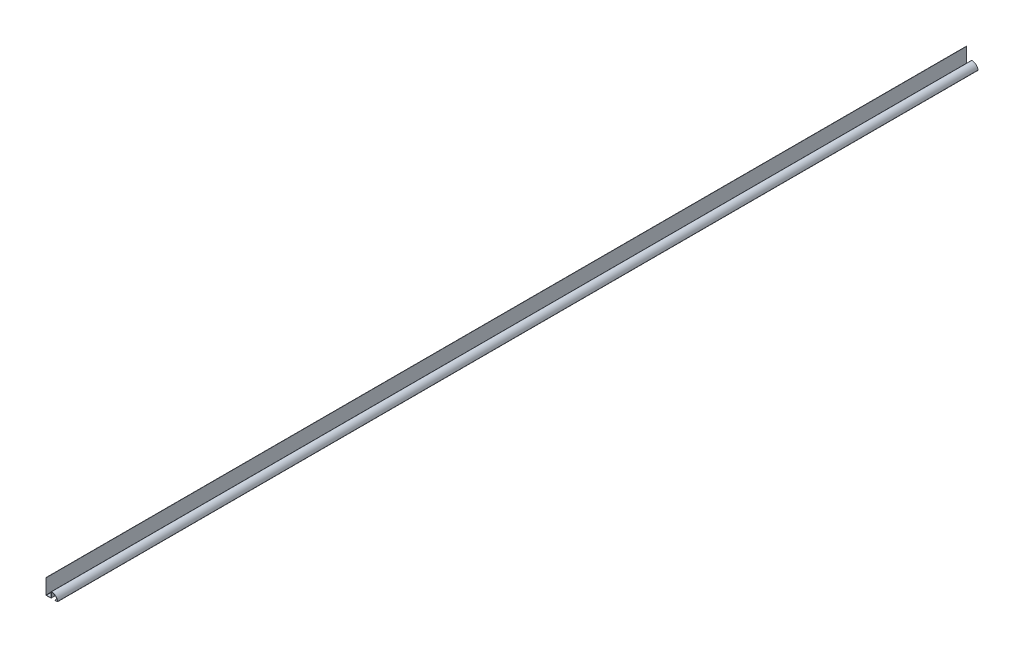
ISO-10303-21;
HEADER;
FILE_DESCRIPTION(('STEP AP214'),'2;1');
FILE_NAME('part.step','',(''),(''),'','','');
FILE_SCHEMA(('AUTOMOTIVE_DESIGN { 1 0 10303 214 1 1 1 1 }'));
ENDSEC;
DATA;
#1=APPLICATION_CONTEXT('core data for automotive mechanical design processes');
#2=APPLICATION_PROTOCOL_DEFINITION('international standard','automotive_design',2000,#1);
#3=PRODUCT_CONTEXT('',#1,'mechanical');
#4=PRODUCT('Part','Part','',(#3));
#5=PRODUCT_RELATED_PRODUCT_CATEGORY('part','',(#4));
#6=PRODUCT_DEFINITION_FORMATION('','',#4);
#7=PRODUCT_DEFINITION_CONTEXT('part definition',#1,'design');
#8=PRODUCT_DEFINITION('design','',#6,#7);
#9=PRODUCT_DEFINITION_SHAPE('','',#8);
#10=(LENGTH_UNIT() NAMED_UNIT(*) SI_UNIT(.MILLI.,.METRE.));
#11=(NAMED_UNIT(*) PLANE_ANGLE_UNIT() SI_UNIT($,.RADIAN.));
#12=(NAMED_UNIT(*) SI_UNIT($,.STERADIAN.) SOLID_ANGLE_UNIT());
#13=UNCERTAINTY_MEASURE_WITH_UNIT(LENGTH_MEASURE(1.E-05),#10,'distance_accuracy_value','');
#14=(GEOMETRIC_REPRESENTATION_CONTEXT(3) GLOBAL_UNCERTAINTY_ASSIGNED_CONTEXT((#13)) GLOBAL_UNIT_ASSIGNED_CONTEXT((#10,
#11,#12)) REPRESENTATION_CONTEXT('',''));
#15=CARTESIAN_POINT('',(0.,0.,0.));
#16=DIRECTION('',(0.,0.,1.));
#17=DIRECTION('',(1.,0.,0.));
#18=AXIS2_PLACEMENT_3D('',#15,#16,#17);
#19=CARTESIAN_POINT('',(24.3888769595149,0.508000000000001,-2000.));
#20=DIRECTION('',(0.,1.,0.));
#21=DIRECTION('',(0.,0.,1.));
#22=AXIS2_PLACEMENT_3D('',#19,#20,#21);
#23=PLANE('',#22);
#24=DIRECTION('',(-1.,0.,0.));
#25=VECTOR('',#24,1.);
#26=CARTESIAN_POINT('',(24.3888769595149,0.508000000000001,0.));
#27=LINE('',#26,#25);
#28=CARTESIAN_POINT('',(24.3888769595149,0.508000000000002,0.));
#29=VERTEX_POINT('',#28);
#30=CARTESIAN_POINT('',(19.05,0.508000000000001,0.));
#31=VERTEX_POINT('',#30);
#32=EDGE_CURVE('E205',#29,#31,#27,.T.);
#33=ORIENTED_EDGE('',*,*,#32,.F.);
#34=DIRECTION('',(0.,0.,1.));
#35=VECTOR('',#34,1.);
#36=CARTESIAN_POINT('',(24.3888769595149,0.508000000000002,-2000.));
#37=LINE('',#36,#35);
#38=CARTESIAN_POINT('',(24.3888769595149,0.508000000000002,-2000.));
#39=VERTEX_POINT('',#38);
#40=EDGE_CURVE('E11',#39,#29,#37,.T.);
#41=ORIENTED_EDGE('',*,*,#40,.F.);
#42=DIRECTION('',(-1.,0.,0.));
#43=VECTOR('',#42,1.);
#44=CARTESIAN_POINT('',(24.3888769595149,0.508000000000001,-2000.));
#45=LINE('',#44,#43);
#46=CARTESIAN_POINT('',(19.05,0.508000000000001,-2000.));
#47=VERTEX_POINT('',#46);
#48=EDGE_CURVE('E251',#39,#47,#45,.T.);
#49=ORIENTED_EDGE('',*,*,#48,.T.);
#50=DIRECTION('',(0.,0.,1.));
#51=VECTOR('',#50,1.);
#52=CARTESIAN_POINT('',(19.05,0.508000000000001,-2000.));
#53=LINE('',#52,#51);
#54=EDGE_CURVE('E40',#47,#31,#53,.T.);
#55=ORIENTED_EDGE('',*,*,#54,.T.);
#56=EDGE_LOOP('',(#33,#41,#49,#55));
#57=FACE_BOUND('',#56,.T.);
#58=ADVANCED_FACE('F37',(#57),#23,.T.);
#59=CARTESIAN_POINT('',(24.3888769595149,1.016,-2000.));
#60=DIRECTION('',(0.,0.,1.));
#61=DIRECTION('',(1.,0.,0.));
#62=AXIS2_PLACEMENT_3D('',#59,#60,#61);
#63=CYLINDRICAL_SURFACE('',#62,0.507999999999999);
#64=CARTESIAN_POINT('',(24.3888769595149,1.016,0.));
#65=DIRECTION('',(0.,0.,-1.));
#66=DIRECTION('',(1.,0.,0.));
#67=AXIS2_PLACEMENT_3D('',#64,#65,#66);
#68=CIRCLE('',#67,0.507999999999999);
#69=CARTESIAN_POINT('',(24.892,1.08622254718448,0.));
#70=VERTEX_POINT('',#69);
#71=EDGE_CURVE('E249',#70,#29,#68,.T.);
#72=ORIENTED_EDGE('',*,*,#71,.F.);
#73=DIRECTION('',(0.,0.,1.));
#74=VECTOR('',#73,1.);
#75=CARTESIAN_POINT('',(24.892,1.08622254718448,-2000.));
#76=LINE('',#75,#74);
#77=CARTESIAN_POINT('',(24.892,1.08622254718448,-2000.));
#78=VERTEX_POINT('',#77);
#79=EDGE_CURVE('E46',#78,#70,#76,.T.);
#80=ORIENTED_EDGE('',*,*,#79,.F.);
#81=CARTESIAN_POINT('',(24.3888769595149,1.016,-2000.));
#82=DIRECTION('',(0.,0.,-1.));
#83=DIRECTION('',(1.,0.,0.));
#84=AXIS2_PLACEMENT_3D('',#81,#82,#83);
#85=CIRCLE('',#84,0.507999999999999);
#86=EDGE_CURVE('E195',#78,#39,#85,.T.);
#87=ORIENTED_EDGE('',*,*,#86,.T.);
#88=ORIENTED_EDGE('',*,*,#40,.T.);
#89=EDGE_LOOP('',(#72,#80,#87,#88));
#90=FACE_BOUND('',#89,.T.);
#91=ADVANCED_FACE('F300',(#90),#63,.F.);
#92=CARTESIAN_POINT('',(12.1285,-0.695221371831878,-2000.));
#93=DIRECTION('',(0.,0.,1.));
#94=DIRECTION('',(1.,0.,0.));
#95=AXIS2_PLACEMENT_3D('',#92,#93,#94);
#96=CYLINDRICAL_SURFACE('',#95,12.8872213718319);
#97=CARTESIAN_POINT('',(12.1285,-0.695221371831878,0.));
#98=DIRECTION('',(0.,0.,-1.));
#99=DIRECTION('',(-1.,0.,0.));
#100=AXIS2_PLACEMENT_3D('',#97,#98,#99);
#101=CIRCLE('',#100,12.8872213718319);
#102=CARTESIAN_POINT('',(12.1285,12.192,0.));
#103=VERTEX_POINT('',#102);
#104=EDGE_CURVE('E183',#103,#70,#101,.T.);
#105=ORIENTED_EDGE('',*,*,#104,.F.);
#106=DIRECTION('',(0.,0.,1.));
#107=VECTOR('',#106,1.);
#108=CARTESIAN_POINT('',(12.1285,12.192,-2000.));
#109=LINE('',#108,#107);
#110=CARTESIAN_POINT('',(12.1285,12.192,-2000.));
#111=VERTEX_POINT('',#110);
#112=EDGE_CURVE('E178',#111,#103,#109,.T.);
#113=ORIENTED_EDGE('',*,*,#112,.F.);
#114=CARTESIAN_POINT('',(12.1285,-0.695221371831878,-2000.));
#115=DIRECTION('',(0.,0.,-1.));
#116=DIRECTION('',(-1.,0.,0.));
#117=AXIS2_PLACEMENT_3D('',#114,#115,#116);
#118=CIRCLE('',#117,12.8872213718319);
#119=EDGE_CURVE('E181',#111,#78,#118,.T.);
#120=ORIENTED_EDGE('',*,*,#119,.T.);
#121=ORIENTED_EDGE('',*,*,#79,.T.);
#122=EDGE_LOOP('',(#105,#113,#120,#121));
#123=FACE_BOUND('',#122,.T.);
#124=ADVANCED_FACE('F180',(#123),#96,.F.);
#125=CARTESIAN_POINT('',(12.1285,11.684,-2000.));
#126=DIRECTION('',(0.,0.,1.));
#127=DIRECTION('',(1.,0.,0.));
#128=AXIS2_PLACEMENT_3D('',#125,#126,#127);
#129=CYLINDRICAL_SURFACE('',#128,0.508000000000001);
#130=CARTESIAN_POINT('',(12.1285,11.684,0.));
#131=DIRECTION('',(0.,0.,-1.));
#132=DIRECTION('',(1.,0.,0.));
#133=AXIS2_PLACEMENT_3D('',#130,#131,#132);
#134=CIRCLE('',#133,0.508000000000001);
#135=CARTESIAN_POINT('',(11.6205,11.684,0.));
#136=VERTEX_POINT('',#135);
#137=EDGE_CURVE('E246',#136,#103,#134,.T.);
#138=ORIENTED_EDGE('',*,*,#137,.F.);
#139=DIRECTION('',(0.,0.,1.));
#140=VECTOR('',#139,1.);
#141=CARTESIAN_POINT('',(11.6205,11.684,-2000.));
#142=LINE('',#141,#140);
#143=CARTESIAN_POINT('',(11.6205,11.684,-2000.));
#144=VERTEX_POINT('',#143);
#145=EDGE_CURVE('E188',#144,#136,#142,.T.);
#146=ORIENTED_EDGE('',*,*,#145,.F.);
#147=CARTESIAN_POINT('',(12.1285,11.684,-2000.));
#148=DIRECTION('',(0.,0.,-1.));
#149=DIRECTION('',(1.,0.,0.));
#150=AXIS2_PLACEMENT_3D('',#147,#148,#149);
#151=CIRCLE('',#150,0.508000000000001);
#152=EDGE_CURVE('E193',#144,#111,#151,.T.);
#153=ORIENTED_EDGE('',*,*,#152,.T.);
#154=ORIENTED_EDGE('',*,*,#112,.T.);
#155=EDGE_LOOP('',(#138,#146,#153,#154));
#156=FACE_BOUND('',#155,.T.);
#157=ADVANCED_FACE('F197',(#156),#129,.F.);
#158=CARTESIAN_POINT('',(11.6205,1.,-2000.));
#159=DIRECTION('',(1.,0.,0.));
#160=DIRECTION('',(0.,0.,-1.));
#161=AXIS2_PLACEMENT_3D('',#158,#159,#160);
#162=PLANE('',#161);
#163=DIRECTION('',(0.,1.,0.));
#164=VECTOR('',#163,1.);
#165=CARTESIAN_POINT('',(11.6205,1.,0.));
#166=LINE('',#165,#164);
#167=CARTESIAN_POINT('',(11.6205,1.,0.));
#168=VERTEX_POINT('',#167);
#169=EDGE_CURVE('E243',#168,#136,#166,.T.);
#170=ORIENTED_EDGE('',*,*,#169,.F.);
#171=DIRECTION('',(0.,0.,1.));
#172=VECTOR('',#171,1.);
#173=CARTESIAN_POINT('',(11.6205,1.,-2000.));
#174=LINE('',#173,#172);
#175=CARTESIAN_POINT('',(11.6205,1.,-2000.));
#176=VERTEX_POINT('',#175);
#177=EDGE_CURVE('E255',#176,#168,#174,.T.);
#178=ORIENTED_EDGE('',*,*,#177,.F.);
#179=DIRECTION('',(0.,1.,0.));
#180=VECTOR('',#179,1.);
#181=CARTESIAN_POINT('',(11.6205,1.,-2000.));
#182=LINE('',#181,#180);
#183=EDGE_CURVE('E198',#176,#144,#182,.T.);
#184=ORIENTED_EDGE('',*,*,#183,.T.);
#185=ORIENTED_EDGE('',*,*,#145,.T.);
#186=EDGE_LOOP('',(#170,#178,#184,#185));
#187=FACE_BOUND('',#186,.T.);
#188=ADVANCED_FACE('F313',(#187),#162,.T.);
#189=CARTESIAN_POINT('',(10.6205,1.,-2000.));
#190=DIRECTION('',(0.,0.,1.));
#191=DIRECTION('',(1.,0.,0.));
#192=AXIS2_PLACEMENT_3D('',#189,#190,#191);
#193=CYLINDRICAL_SURFACE('',#192,1.);
#194=CARTESIAN_POINT('',(10.6205,1.,0.));
#195=DIRECTION('',(0.,0.,1.));
#196=DIRECTION('',(1.,0.,0.));
#197=AXIS2_PLACEMENT_3D('',#194,#195,#196);
#198=CIRCLE('',#197,1.);
#199=CARTESIAN_POINT('',(10.6205,0.,0.));
#200=VERTEX_POINT('',#199);
#201=EDGE_CURVE('E240',#200,#168,#198,.T.);
#202=ORIENTED_EDGE('',*,*,#201,.F.);
#203=DIRECTION('',(0.,0.,1.));
#204=VECTOR('',#203,1.);
#205=CARTESIAN_POINT('',(10.6205,0.,-2000.));
#206=LINE('',#205,#204);
#207=CARTESIAN_POINT('',(10.6205,0.,-2000.));
#208=VERTEX_POINT('',#207);
#209=EDGE_CURVE('E257',#208,#200,#206,.T.);
#210=ORIENTED_EDGE('',*,*,#209,.F.);
#211=CARTESIAN_POINT('',(10.6205,1.,-2000.));
#212=DIRECTION('',(0.,0.,1.));
#213=DIRECTION('',(1.,0.,0.));
#214=AXIS2_PLACEMENT_3D('',#211,#212,#213);
#215=CIRCLE('',#214,1.);
#216=EDGE_CURVE('E200',#208,#176,#215,.T.);
#217=ORIENTED_EDGE('',*,*,#216,.T.);
#218=ORIENTED_EDGE('',*,*,#177,.T.);
#219=EDGE_LOOP('',(#202,#210,#217,#218));
#220=FACE_BOUND('',#219,.T.);
#221=ADVANCED_FACE('F316',(#220),#193,.T.);
#222=CARTESIAN_POINT('',(1.,0.,-2000.));
#223=DIRECTION('',(0.,-1.,0.));
#224=DIRECTION('',(0.,0.,-1.));
#225=AXIS2_PLACEMENT_3D('',#222,#223,#224);
#226=PLANE('',#225);
#227=DIRECTION('',(1.,0.,0.));
#228=VECTOR('',#227,1.);
#229=CARTESIAN_POINT('',(1.,0.,0.));
#230=LINE('',#229,#228);
#231=CARTESIAN_POINT('',(1.,0.,0.));
#232=VERTEX_POINT('',#231);
#233=EDGE_CURVE('E237',#232,#200,#230,.T.);
#234=ORIENTED_EDGE('',*,*,#233,.F.);
#235=DIRECTION('',(0.,0.,1.));
#236=VECTOR('',#235,1.);
#237=CARTESIAN_POINT('',(1.,0.,-2000.));
#238=LINE('',#237,#236);
#239=CARTESIAN_POINT('',(1.,0.,-2000.));
#240=VERTEX_POINT('',#239);
#241=EDGE_CURVE('E259',#240,#232,#238,.T.);
#242=ORIENTED_EDGE('',*,*,#241,.F.);
#243=DIRECTION('',(1.,0.,0.));
#244=VECTOR('',#243,1.);
#245=CARTESIAN_POINT('',(1.,0.,-2000.));
#246=LINE('',#245,#244);
#247=EDGE_CURVE('E553',#240,#208,#246,.T.);
#248=ORIENTED_EDGE('',*,*,#247,.T.);
#249=ORIENTED_EDGE('',*,*,#209,.T.);
#250=EDGE_LOOP('',(#234,#242,#248,#249));
#251=FACE_BOUND('',#250,.T.);
#252=ADVANCED_FACE('F320',(#251),#226,.T.);
#253=CARTESIAN_POINT('',(1.,1.,-2000.));
#254=DIRECTION('',(0.,0.,1.));
#255=DIRECTION('',(1.,0.,0.));
#256=AXIS2_PLACEMENT_3D('',#253,#254,#255);
#257=CYLINDRICAL_SURFACE('',#256,1.);
#258=CARTESIAN_POINT('',(1.,1.,0.));
#259=DIRECTION('',(0.,0.,1.));
#260=DIRECTION('',(1.,0.,0.));
#261=AXIS2_PLACEMENT_3D('',#258,#259,#260);
#262=CIRCLE('',#261,1.);
#263=CARTESIAN_POINT('',(0.,1.,0.));
#264=VERTEX_POINT('',#263);
#265=EDGE_CURVE('E234',#264,#232,#262,.T.);
#266=ORIENTED_EDGE('',*,*,#265,.F.);
#267=DIRECTION('',(0.,0.,1.));
#268=VECTOR('',#267,1.);
#269=CARTESIAN_POINT('',(0.,1.,-2000.));
#270=LINE('',#269,#268);
#271=CARTESIAN_POINT('',(0.,1.,-2000.));
#272=VERTEX_POINT('',#271);
#273=EDGE_CURVE('E261',#272,#264,#270,.T.);
#274=ORIENTED_EDGE('',*,*,#273,.F.);
#275=CARTESIAN_POINT('',(1.,1.,-2000.));
#276=DIRECTION('',(0.,0.,1.));
#277=DIRECTION('',(1.,0.,0.));
#278=AXIS2_PLACEMENT_3D('',#275,#276,#277);
#279=CIRCLE('',#278,1.);
#280=EDGE_CURVE('E557',#272,#240,#279,.T.);
#281=ORIENTED_EDGE('',*,*,#280,.T.);
#282=ORIENTED_EDGE('',*,*,#241,.T.);
#283=EDGE_LOOP('',(#266,#274,#281,#282));
#284=FACE_BOUND('',#283,.T.);
#285=ADVANCED_FACE('F324',(#284),#257,.T.);
#286=CARTESIAN_POINT('',(0.,1.,-2000.));
#287=DIRECTION('',(-1.,0.,0.));
#288=DIRECTION('',(0.,0.,1.));
#289=AXIS2_PLACEMENT_3D('',#286,#287,#288);
#290=PLANE('',#289);
#291=DIRECTION('',(0.,-1.,0.));
#292=VECTOR('',#291,1.);
#293=CARTESIAN_POINT('',(0.,1.,0.));
#294=LINE('',#293,#292);
#295=CARTESIAN_POINT('',(0.,33.3375,0.));
#296=VERTEX_POINT('',#295);
#297=EDGE_CURVE('E231',#296,#264,#294,.T.);
#298=ORIENTED_EDGE('',*,*,#297,.F.);
#299=DIRECTION('',(0.,0.,1.));
#300=VECTOR('',#299,1.);
#301=CARTESIAN_POINT('',(0.,33.3375,-2000.));
#302=LINE('',#301,#300);
#303=CARTESIAN_POINT('',(0.,33.3375,-2000.));
#304=VERTEX_POINT('',#303);
#305=EDGE_CURVE('E263',#304,#296,#302,.T.);
#306=ORIENTED_EDGE('',*,*,#305,.F.);
#307=DIRECTION('',(0.,-1.,0.));
#308=VECTOR('',#307,1.);
#309=CARTESIAN_POINT('',(0.,1.,-2000.));
#310=LINE('',#309,#308);
#311=EDGE_CURVE('E546',#304,#272,#310,.T.);
#312=ORIENTED_EDGE('',*,*,#311,.T.);
#313=ORIENTED_EDGE('',*,*,#273,.T.);
#314=EDGE_LOOP('',(#298,#306,#312,#313));
#315=FACE_BOUND('',#314,.T.);
#316=ADVANCED_FACE('F328',(#315),#290,.T.);
#317=CARTESIAN_POINT('',(0.,33.3375,-2000.));
#318=DIRECTION('',(0.,-1.,0.));
#319=DIRECTION('',(0.,0.,-1.));
#320=AXIS2_PLACEMENT_3D('',#317,#318,#319);
#321=PLANE('',#320);
#322=DIRECTION('',(1.,0.,0.));
#323=VECTOR('',#322,1.);
#324=CARTESIAN_POINT('',(0.,33.3375,0.));
#325=LINE('',#324,#323);
#326=CARTESIAN_POINT('',(0.508,33.3375,0.));
#327=VERTEX_POINT('',#326);
#328=EDGE_CURVE('E229',#296,#327,#325,.T.);
#329=ORIENTED_EDGE('',*,*,#328,.T.);
#330=DIRECTION('',(0.,0.,1.));
#331=VECTOR('',#330,1.);
#332=CARTESIAN_POINT('',(0.508,33.3375,-2000.));
#333=LINE('',#332,#331);
#334=CARTESIAN_POINT('',(0.508,33.3375,-2000.));
#335=VERTEX_POINT('',#334);
#336=EDGE_CURVE('E265',#335,#327,#333,.T.);
#337=ORIENTED_EDGE('',*,*,#336,.F.);
#338=DIRECTION('',(1.,0.,0.));
#339=VECTOR('',#338,1.);
#340=CARTESIAN_POINT('',(0.,33.3375,-2000.));
#341=LINE('',#340,#339);
#342=EDGE_CURVE('E541',#304,#335,#341,.T.);
#343=ORIENTED_EDGE('',*,*,#342,.F.);
#344=ORIENTED_EDGE('',*,*,#305,.T.);
#345=EDGE_LOOP('',(#329,#337,#343,#344));
#346=FACE_BOUND('',#345,.T.);
#347=ADVANCED_FACE('F332',(#346),#321,.F.);
#348=CARTESIAN_POINT('',(0.508,1.,-2000.));
#349=DIRECTION('',(-1.,0.,0.));
#350=DIRECTION('',(0.,0.,1.));
#351=AXIS2_PLACEMENT_3D('',#348,#349,#350);
#352=PLANE('',#351);
#353=DIRECTION('',(0.,1.,0.));
#354=VECTOR('',#353,1.);
#355=CARTESIAN_POINT('',(0.508,1.,0.));
#356=LINE('',#355,#354);
#357=CARTESIAN_POINT('',(0.508,1.,0.));
#358=VERTEX_POINT('',#357);
#359=EDGE_CURVE('E227',#327,#358,#356,.F.);
#360=ORIENTED_EDGE('',*,*,#359,.T.);
#361=DIRECTION('',(0.,0.,1.));
#362=VECTOR('',#361,1.);
#363=CARTESIAN_POINT('',(0.508,1.,-2000.));
#364=LINE('',#363,#362);
#365=CARTESIAN_POINT('',(0.508,1.,-2000.));
#366=VERTEX_POINT('',#365);
#367=EDGE_CURVE('E268',#366,#358,#364,.T.);
#368=ORIENTED_EDGE('',*,*,#367,.F.);
#369=DIRECTION('',(0.,1.,0.));
#370=VECTOR('',#369,1.);
#371=CARTESIAN_POINT('',(0.508,1.,-2000.));
#372=LINE('',#371,#370);
#373=EDGE_CURVE('E538',#335,#366,#372,.F.);
#374=ORIENTED_EDGE('',*,*,#373,.F.);
#375=ORIENTED_EDGE('',*,*,#336,.T.);
#376=EDGE_LOOP('',(#360,#368,#374,#375));
#377=FACE_BOUND('',#376,.T.);
#378=ADVANCED_FACE('F336',(#377),#352,.F.);
#379=CARTESIAN_POINT('',(1.,1.,-2000.));
#380=DIRECTION('',(0.,0.,1.));
#381=DIRECTION('',(1.,0.,0.));
#382=AXIS2_PLACEMENT_3D('',#379,#380,#381);
#383=CYLINDRICAL_SURFACE('',#382,0.492);
#384=CARTESIAN_POINT('',(1.,1.,0.));
#385=DIRECTION('',(0.,0.,1.));
#386=DIRECTION('',(1.,0.,0.));
#387=AXIS2_PLACEMENT_3D('',#384,#385,#386);
#388=CIRCLE('',#387,0.492);
#389=CARTESIAN_POINT('',(1.,0.508,0.));
#390=VERTEX_POINT('',#389);
#391=EDGE_CURVE('E225',#358,#390,#388,.T.);
#392=ORIENTED_EDGE('',*,*,#391,.T.);
#393=DIRECTION('',(0.,0.,1.));
#394=VECTOR('',#393,1.);
#395=CARTESIAN_POINT('',(1.,0.508,-2000.));
#396=LINE('',#395,#394);
#397=CARTESIAN_POINT('',(1.,0.508,-2000.));
#398=VERTEX_POINT('',#397);
#399=EDGE_CURVE('E271',#398,#390,#396,.T.);
#400=ORIENTED_EDGE('',*,*,#399,.F.);
#401=CARTESIAN_POINT('',(1.,1.,-2000.));
#402=DIRECTION('',(0.,0.,1.));
#403=DIRECTION('',(1.,0.,0.));
#404=AXIS2_PLACEMENT_3D('',#401,#402,#403);
#405=CIRCLE('',#404,0.492);
#406=EDGE_CURVE('E536',#366,#398,#405,.T.);
#407=ORIENTED_EDGE('',*,*,#406,.F.);
#408=ORIENTED_EDGE('',*,*,#367,.T.);
#409=EDGE_LOOP('',(#392,#400,#407,#408));
#410=FACE_BOUND('',#409,.T.);
#411=ADVANCED_FACE('F340',(#410),#383,.F.);
#412=CARTESIAN_POINT('',(1.,0.508,-2000.));
#413=DIRECTION('',(0.,-1.,0.));
#414=DIRECTION('',(0.,0.,-1.));
#415=AXIS2_PLACEMENT_3D('',#412,#413,#414);
#416=PLANE('',#415);
#417=DIRECTION('',(1.,0.,0.));
#418=VECTOR('',#417,1.);
#419=CARTESIAN_POINT('',(1.,0.508,0.));
#420=LINE('',#419,#418);
#421=CARTESIAN_POINT('',(10.6205,0.508,0.));
#422=VERTEX_POINT('',#421);
#423=EDGE_CURVE('E223',#390,#422,#420,.T.);
#424=ORIENTED_EDGE('',*,*,#423,.T.);
#425=DIRECTION('',(0.,0.,1.));
#426=VECTOR('',#425,1.);
#427=CARTESIAN_POINT('',(10.6205,0.508,-2000.));
#428=LINE('',#427,#426);
#429=CARTESIAN_POINT('',(10.6205,0.508,-2000.));
#430=VERTEX_POINT('',#429);
#431=EDGE_CURVE('E274',#430,#422,#428,.T.);
#432=ORIENTED_EDGE('',*,*,#431,.F.);
#433=DIRECTION('',(1.,0.,0.));
#434=VECTOR('',#433,1.);
#435=CARTESIAN_POINT('',(1.,0.508,-2000.));
#436=LINE('',#435,#434);
#437=EDGE_CURVE('E529',#398,#430,#436,.T.);
#438=ORIENTED_EDGE('',*,*,#437,.F.);
#439=ORIENTED_EDGE('',*,*,#399,.T.);
#440=EDGE_LOOP('',(#424,#432,#438,#439));
#441=FACE_BOUND('',#440,.T.);
#442=ADVANCED_FACE('F344',(#441),#416,.F.);
#443=CARTESIAN_POINT('',(10.6205,1.,-2000.));
#444=DIRECTION('',(0.,0.,1.));
#445=DIRECTION('',(1.,0.,0.));
#446=AXIS2_PLACEMENT_3D('',#443,#444,#445);
#447=CYLINDRICAL_SURFACE('',#446,0.492000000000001);
#448=CARTESIAN_POINT('',(10.6205,1.,0.));
#449=DIRECTION('',(0.,0.,1.));
#450=DIRECTION('',(1.,0.,0.));
#451=AXIS2_PLACEMENT_3D('',#448,#449,#450);
#452=CIRCLE('',#451,0.492000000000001);
#453=CARTESIAN_POINT('',(11.1125,1.,0.));
#454=VERTEX_POINT('',#453);
#455=EDGE_CURVE('E221',#422,#454,#452,.T.);
#456=ORIENTED_EDGE('',*,*,#455,.T.);
#457=DIRECTION('',(0.,0.,1.));
#458=VECTOR('',#457,1.);
#459=CARTESIAN_POINT('',(11.1125,1.,-2000.));
#460=LINE('',#459,#458);
#461=CARTESIAN_POINT('',(11.1125,1.,-2000.));
#462=VERTEX_POINT('',#461);
#463=EDGE_CURVE('E277',#462,#454,#460,.T.);
#464=ORIENTED_EDGE('',*,*,#463,.F.);
#465=CARTESIAN_POINT('',(10.6205,1.,-2000.));
#466=DIRECTION('',(0.,0.,1.));
#467=DIRECTION('',(1.,0.,0.));
#468=AXIS2_PLACEMENT_3D('',#465,#466,#467);
#469=CIRCLE('',#468,0.492000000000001);
#470=EDGE_CURVE('E526',#430,#462,#469,.T.);
#471=ORIENTED_EDGE('',*,*,#470,.F.);
#472=ORIENTED_EDGE('',*,*,#431,.T.);
#473=EDGE_LOOP('',(#456,#464,#471,#472));
#474=FACE_BOUND('',#473,.T.);
#475=ADVANCED_FACE('F348',(#474),#447,.F.);
#476=CARTESIAN_POINT('',(11.1125,1.,-2000.));
#477=DIRECTION('',(1.,0.,0.));
#478=DIRECTION('',(0.,0.,-1.));
#479=AXIS2_PLACEMENT_3D('',#476,#477,#478);
#480=PLANE('',#479);
#481=DIRECTION('',(0.,1.,0.));
#482=VECTOR('',#481,1.);
#483=CARTESIAN_POINT('',(11.1125,1.,0.));
#484=LINE('',#483,#482);
#485=CARTESIAN_POINT('',(11.1125,11.684,0.));
#486=VERTEX_POINT('',#485);
#487=EDGE_CURVE('E219',#454,#486,#484,.T.);
#488=ORIENTED_EDGE('',*,*,#487,.T.);
#489=DIRECTION('',(0.,0.,1.));
#490=VECTOR('',#489,1.);
#491=CARTESIAN_POINT('',(11.1125,11.684,-2000.));
#492=LINE('',#491,#490);
#493=CARTESIAN_POINT('',(11.1125,11.684,-2000.));
#494=VERTEX_POINT('',#493);
#495=EDGE_CURVE('E280',#494,#486,#492,.T.);
#496=ORIENTED_EDGE('',*,*,#495,.F.);
#497=DIRECTION('',(0.,1.,0.));
#498=VECTOR('',#497,1.);
#499=CARTESIAN_POINT('',(11.1125,1.,-2000.));
#500=LINE('',#499,#498);
#501=EDGE_CURVE('E524',#462,#494,#500,.T.);
#502=ORIENTED_EDGE('',*,*,#501,.F.);
#503=ORIENTED_EDGE('',*,*,#463,.T.);
#504=EDGE_LOOP('',(#488,#496,#502,#503));
#505=FACE_BOUND('',#504,.T.);
#506=ADVANCED_FACE('F352',(#505),#480,.F.);
#507=CARTESIAN_POINT('',(12.1285,11.684,-2000.));
#508=DIRECTION('',(0.,0.,1.));
#509=DIRECTION('',(1.,0.,0.));
#510=AXIS2_PLACEMENT_3D('',#507,#508,#509);
#511=CYLINDRICAL_SURFACE('',#510,1.016);
#512=CARTESIAN_POINT('',(12.1285,11.684,0.));
#513=DIRECTION('',(0.,0.,1.));
#514=DIRECTION('',(1.,0.,0.));
#515=AXIS2_PLACEMENT_3D('',#512,#513,#514);
#516=CIRCLE('',#515,1.016);
#517=CARTESIAN_POINT('',(12.1285,12.7,0.));
#518=VERTEX_POINT('',#517);
#519=EDGE_CURVE('E217',#486,#518,#516,.F.);
#520=ORIENTED_EDGE('',*,*,#519,.T.);
#521=DIRECTION('',(0.,0.,1.));
#522=VECTOR('',#521,1.);
#523=CARTESIAN_POINT('',(12.1285,12.7,-2000.));
#524=LINE('',#523,#522);
#525=CARTESIAN_POINT('',(12.1285,12.7,-2000.));
#526=VERTEX_POINT('',#525);
#527=EDGE_CURVE('E283',#526,#518,#524,.T.);
#528=ORIENTED_EDGE('',*,*,#527,.F.);
#529=CARTESIAN_POINT('',(12.1285,11.684,-2000.));
#530=DIRECTION('',(0.,0.,1.));
#531=DIRECTION('',(1.,0.,0.));
#532=AXIS2_PLACEMENT_3D('',#529,#530,#531);
#533=CIRCLE('',#532,1.016);
#534=EDGE_CURVE('E517',#494,#526,#533,.F.);
#535=ORIENTED_EDGE('',*,*,#534,.F.);
#536=ORIENTED_EDGE('',*,*,#495,.T.);
#537=EDGE_LOOP('',(#520,#528,#535,#536));
#538=FACE_BOUND('',#537,.T.);
#539=ADVANCED_FACE('F356',(#538),#511,.T.);
#540=CARTESIAN_POINT('',(12.1285,-0.695221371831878,-2000.));
#541=DIRECTION('',(0.,0.,1.));
#542=DIRECTION('',(1.,0.,0.));
#543=AXIS2_PLACEMENT_3D('',#540,#541,#542);
#544=CYLINDRICAL_SURFACE('',#543,13.3952213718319);
#545=CARTESIAN_POINT('',(12.1285,-0.695221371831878,0.));
#546=DIRECTION('',(0.,0.,1.));
#547=DIRECTION('',(1.,0.,0.));
#548=AXIS2_PLACEMENT_3D('',#545,#546,#547);
#549=CIRCLE('',#548,13.3952213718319);
#550=CARTESIAN_POINT('',(25.395123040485,1.15644509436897,0.));
#551=VERTEX_POINT('',#550);
#552=EDGE_CURVE('E215',#518,#551,#549,.F.);
#553=ORIENTED_EDGE('',*,*,#552,.T.);
#554=DIRECTION('',(0.,0.,1.));
#555=VECTOR('',#554,1.);
#556=CARTESIAN_POINT('',(25.395123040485,1.15644509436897,-2000.));
#557=LINE('',#556,#555);
#558=CARTESIAN_POINT('',(25.395123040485,1.15644509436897,-2000.));
#559=VERTEX_POINT('',#558);
#560=EDGE_CURVE('E286',#559,#551,#557,.T.);
#561=ORIENTED_EDGE('',*,*,#560,.F.);
#562=CARTESIAN_POINT('',(12.1285,-0.695221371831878,-2000.));
#563=DIRECTION('',(0.,0.,1.));
#564=DIRECTION('',(1.,0.,0.));
#565=AXIS2_PLACEMENT_3D('',#562,#563,#564);
#566=CIRCLE('',#565,13.3952213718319);
#567=EDGE_CURVE('E514',#526,#559,#566,.F.);
#568=ORIENTED_EDGE('',*,*,#567,.F.);
#569=ORIENTED_EDGE('',*,*,#527,.T.);
#570=EDGE_LOOP('',(#553,#561,#568,#569));
#571=FACE_BOUND('',#570,.T.);
#572=ADVANCED_FACE('F360',(#571),#544,.T.);
#573=CARTESIAN_POINT('',(24.3888769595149,1.016,-2000.));
#574=DIRECTION('',(0.,0.,1.));
#575=DIRECTION('',(1.,0.,0.));
#576=AXIS2_PLACEMENT_3D('',#573,#574,#575);
#577=CYLINDRICAL_SURFACE('',#576,1.016);
#578=CARTESIAN_POINT('',(24.3888769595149,1.016,0.));
#579=DIRECTION('',(0.,0.,1.));
#580=DIRECTION('',(1.,0.,0.));
#581=AXIS2_PLACEMENT_3D('',#578,#579,#580);
#582=CIRCLE('',#581,1.016);
#583=CARTESIAN_POINT('',(24.3888769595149,0.,0.));
#584=VERTEX_POINT('',#583);
#585=EDGE_CURVE('E213',#551,#584,#582,.F.);
#586=ORIENTED_EDGE('',*,*,#585,.T.);
#587=DIRECTION('',(0.,0.,1.));
#588=VECTOR('',#587,1.);
#589=CARTESIAN_POINT('',(24.3888769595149,0.,-2000.));
#590=LINE('',#589,#588);
#591=CARTESIAN_POINT('',(24.3888769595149,0.,-2000.));
#592=VERTEX_POINT('',#591);
#593=EDGE_CURVE('E289',#592,#584,#590,.T.);
#594=ORIENTED_EDGE('',*,*,#593,.F.);
#595=CARTESIAN_POINT('',(24.3888769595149,1.016,-2000.));
#596=DIRECTION('',(0.,0.,1.));
#597=DIRECTION('',(1.,0.,0.));
#598=AXIS2_PLACEMENT_3D('',#595,#596,#597);
#599=CIRCLE('',#598,1.016);
#600=EDGE_CURVE('E512',#559,#592,#599,.F.);
#601=ORIENTED_EDGE('',*,*,#600,.F.);
#602=ORIENTED_EDGE('',*,*,#560,.T.);
#603=EDGE_LOOP('',(#586,#594,#601,#602));
#604=FACE_BOUND('',#603,.T.);
#605=ADVANCED_FACE('F364',(#604),#577,.T.);
#606=CARTESIAN_POINT('',(24.3888769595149,0.,-2000.));
#607=DIRECTION('',(0.,1.,0.));
#608=DIRECTION('',(0.,0.,1.));
#609=AXIS2_PLACEMENT_3D('',#606,#607,#608);
#610=PLANE('',#609);
#611=DIRECTION('',(1.,0.,0.));
#612=VECTOR('',#611,1.);
#613=CARTESIAN_POINT('',(24.3888769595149,0.,0.));
#614=LINE('',#613,#612);
#615=CARTESIAN_POINT('',(19.05,0.,0.));
#616=VERTEX_POINT('',#615);
#617=EDGE_CURVE('E211',#584,#616,#614,.F.);
#618=ORIENTED_EDGE('',*,*,#617,.T.);
#619=DIRECTION('',(0.,0.,1.));
#620=VECTOR('',#619,1.);
#621=CARTESIAN_POINT('',(19.05,0.,-2000.));
#622=LINE('',#621,#620);
#623=CARTESIAN_POINT('',(19.05,0.,-2000.));
#624=VERTEX_POINT('',#623);
#625=EDGE_CURVE('E291',#624,#616,#622,.T.);
#626=ORIENTED_EDGE('',*,*,#625,.F.);
#627=DIRECTION('',(1.,0.,0.));
#628=VECTOR('',#627,1.);
#629=CARTESIAN_POINT('',(24.3888769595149,0.,-2000.));
#630=LINE('',#629,#628);
#631=EDGE_CURVE('E571',#592,#624,#630,.F.);
#632=ORIENTED_EDGE('',*,*,#631,.F.);
#633=ORIENTED_EDGE('',*,*,#593,.T.);
#634=EDGE_LOOP('',(#618,#626,#632,#633));
#635=FACE_BOUND('',#634,.T.);
#636=ADVANCED_FACE('F368',(#635),#610,.F.);
#637=CARTESIAN_POINT('',(19.05,0.,-2000.));
#638=DIRECTION('',(1.,0.,0.));
#639=DIRECTION('',(0.,0.,-1.));
#640=AXIS2_PLACEMENT_3D('',#637,#638,#639);
#641=PLANE('',#640);
#642=DIRECTION('',(0.,1.,0.));
#643=VECTOR('',#642,1.);
#644=CARTESIAN_POINT('',(19.05,0.,0.));
#645=LINE('',#644,#643);
#646=EDGE_CURVE('E208',#616,#31,#645,.T.);
#647=ORIENTED_EDGE('',*,*,#646,.T.);
#648=ORIENTED_EDGE('',*,*,#54,.F.);
#649=DIRECTION('',(0.,1.,0.));
#650=VECTOR('',#649,1.);
#651=CARTESIAN_POINT('',(19.05,0.,-2000.));
#652=LINE('',#651,#650);
#653=EDGE_CURVE('E129',#624,#47,#652,.T.);
#654=ORIENTED_EDGE('',*,*,#653,.F.);
#655=ORIENTED_EDGE('',*,*,#625,.T.);
#656=EDGE_LOOP('',(#647,#648,#654,#655));
#657=FACE_BOUND('',#656,.T.);
#658=ADVANCED_FACE('F296',(#657),#641,.F.);
#659=CARTESIAN_POINT('',(24.3888769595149,1.016,-2000.));
#660=DIRECTION('',(0.,0.,1.));
#661=DIRECTION('',(1.,0.,0.));
#662=AXIS2_PLACEMENT_3D('',#659,#660,#661);
#663=PLANE('',#662);
#664=ORIENTED_EDGE('',*,*,#48,.F.);
#665=ORIENTED_EDGE('',*,*,#86,.F.);
#666=ORIENTED_EDGE('',*,*,#119,.F.);
#667=ORIENTED_EDGE('',*,*,#152,.F.);
#668=ORIENTED_EDGE('',*,*,#183,.F.);
#669=ORIENTED_EDGE('',*,*,#216,.F.);
#670=ORIENTED_EDGE('',*,*,#247,.F.);
#671=ORIENTED_EDGE('',*,*,#280,.F.);
#672=ORIENTED_EDGE('',*,*,#311,.F.);
#673=ORIENTED_EDGE('',*,*,#342,.T.);
#674=ORIENTED_EDGE('',*,*,#373,.T.);
#675=ORIENTED_EDGE('',*,*,#406,.T.);
#676=ORIENTED_EDGE('',*,*,#437,.T.);
#677=ORIENTED_EDGE('',*,*,#470,.T.);
#678=ORIENTED_EDGE('',*,*,#501,.T.);
#679=ORIENTED_EDGE('',*,*,#534,.T.);
#680=ORIENTED_EDGE('',*,*,#567,.T.);
#681=ORIENTED_EDGE('',*,*,#600,.T.);
#682=ORIENTED_EDGE('',*,*,#631,.T.);
#683=ORIENTED_EDGE('',*,*,#653,.T.);
#684=EDGE_LOOP('',(#664,#665,#666,#667,#668,#669,#670,#671,#672,#673,#674,#675,#676,#677,#678,
#679,#680,#681,#682,#683));
#685=FACE_BOUND('',#684,.T.);
#686=ADVANCED_FACE('F191',(#685),#663,.F.);
#687=CARTESIAN_POINT('',(24.3888769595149,1.016,0.));
#688=DIRECTION('',(0.,0.,1.));
#689=DIRECTION('',(1.,0.,0.));
#690=AXIS2_PLACEMENT_3D('',#687,#688,#689);
#691=PLANE('',#690);
#692=ORIENTED_EDGE('',*,*,#32,.T.);
#693=ORIENTED_EDGE('',*,*,#646,.F.);
#694=ORIENTED_EDGE('',*,*,#617,.F.);
#695=ORIENTED_EDGE('',*,*,#585,.F.);
#696=ORIENTED_EDGE('',*,*,#552,.F.);
#697=ORIENTED_EDGE('',*,*,#519,.F.);
#698=ORIENTED_EDGE('',*,*,#487,.F.);
#699=ORIENTED_EDGE('',*,*,#455,.F.);
#700=ORIENTED_EDGE('',*,*,#423,.F.);
#701=ORIENTED_EDGE('',*,*,#391,.F.);
#702=ORIENTED_EDGE('',*,*,#359,.F.);
#703=ORIENTED_EDGE('',*,*,#328,.F.);
#704=ORIENTED_EDGE('',*,*,#297,.T.);
#705=ORIENTED_EDGE('',*,*,#265,.T.);
#706=ORIENTED_EDGE('',*,*,#233,.T.);
#707=ORIENTED_EDGE('',*,*,#201,.T.);
#708=ORIENTED_EDGE('',*,*,#169,.T.);
#709=ORIENTED_EDGE('',*,*,#137,.T.);
#710=ORIENTED_EDGE('',*,*,#104,.T.);
#711=ORIENTED_EDGE('',*,*,#71,.T.);
#712=EDGE_LOOP('',(#692,#693,#694,#695,#696,#697,#698,#699,#700,#701,#702,#703,#704,#705,#706,
#707,#708,#709,#710,#711));
#713=FACE_BOUND('',#712,.T.);
#714=ADVANCED_FACE('F299',(#713),#691,.T.);
#715=CLOSED_SHELL('',(#58,#91,#124,#157,#188,#221,#252,#285,#316,#347,#378,#411,#442,#475,#506,
#539,#572,#605,#636,#658,#686,#714));
#716=MANIFOLD_SOLID_BREP('B2',#715);
#717=ADVANCED_BREP_SHAPE_REPRESENTATION('',(#18,#716),#14);
#718=SHAPE_DEFINITION_REPRESENTATION(#9,#717);
ENDSEC;
END-ISO-10303-21;
